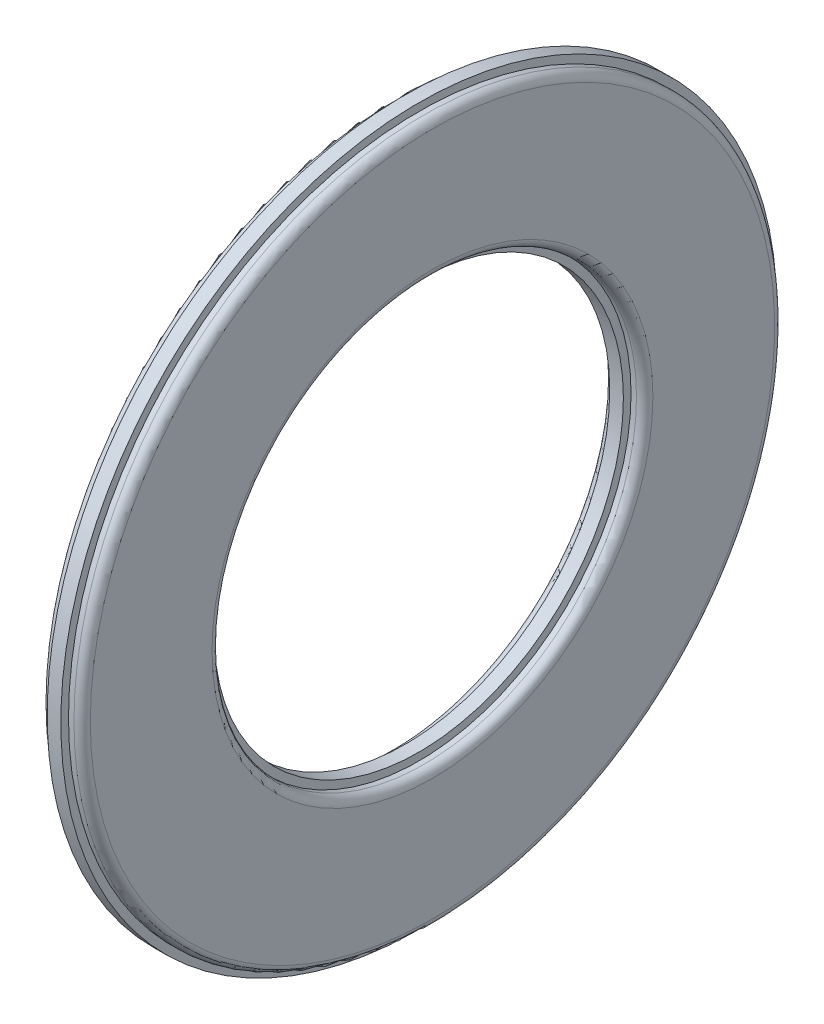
from build123d import *

# Parameters (mm, degrees)
CAGSPISKE_W = 0.666666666
CAGSPISKE_H = 7.5


with BuildPart() as part:
    # CagSpiSke → CageSpine (revolve)
    with BuildSketch(Plane.XY, mode=Mode.PRIVATE) as cagespine_sk:
        with Locations((0, 13.75)):
            Rectangle(CAGSPISKE_W, CAGSPISKE_H)
    revolve(cagespine_sk.sketch.rotate(Axis((-34.925, 0, 0), (1, 0, 0)), 270), axis=Axis((-34.925, 0, 0), (1, 0, 0)))

    # RolSimSke → RollersSimplified (revolve)
    with BuildSketch(Plane.XY, mode=Mode.PRIVATE) as rollerssimplified_sk:
        with BuildLine():
            Line((-0.6, 17.125), (0.6, 17.125))
            ThreePointArc((0.6, 17.125), (0.882842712, 17.007842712), (1, 16.725))
            Line((1, 16.725), (1, 10.775))
            ThreePointArc((1, 10.775), (0.882842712, 10.492157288), (0.6, 10.375))
            Line((0.6, 10.375), (-0.6, 10.375))
            ThreePointArc((-0.6, 10.375), (-0.882842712, 10.492157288), (-1, 10.775))
            Line((-1, 10.775), (-1, 16.725))
            ThreePointArc((-1, 16.725), (-0.882842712, 17.007842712), (-0.6, 17.125))
        make_face()
    revolve(rollerssimplified_sk.sketch.rotate(Axis((-17.78, 0, 0), (1, 0, 0)), 90), axis=Axis((-17.78, 0, 0), (1, 0, 0)))


solid = part.part
